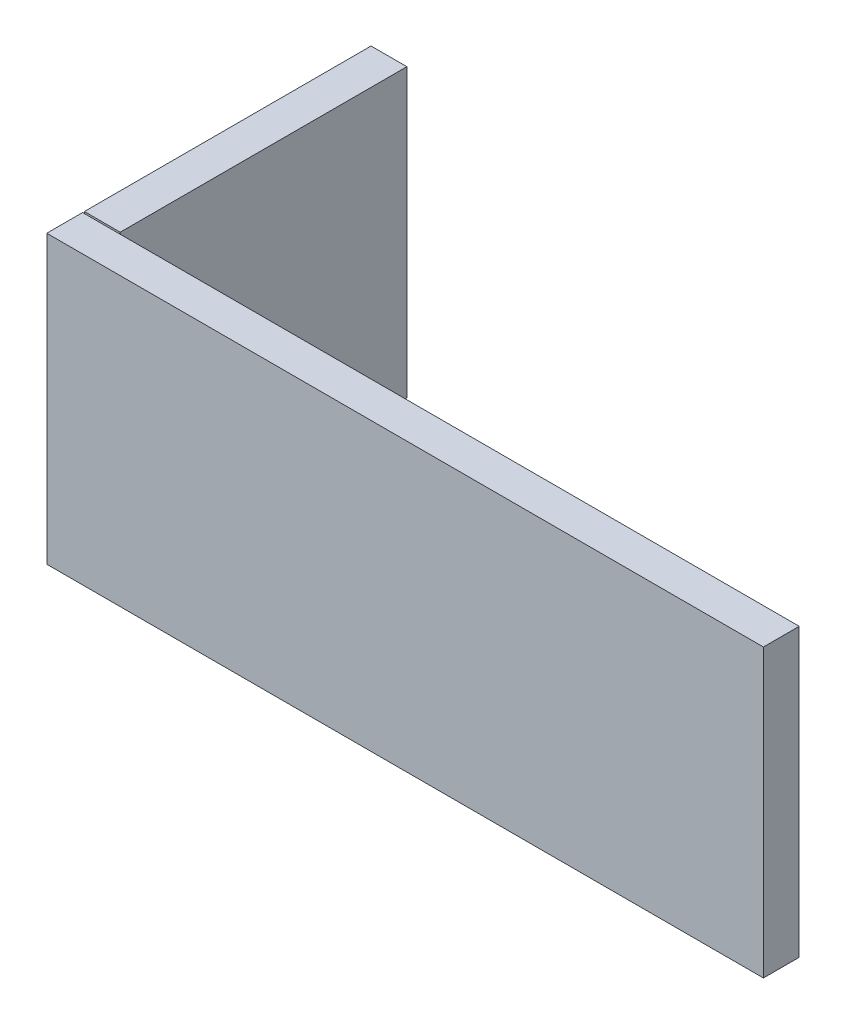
from build123d import *

# Parameters (mm, degrees)
SKETCH1_W             = 254
SKETCH1_H             = 12.7
BOSS_EXTRUDE1_DEPTH   = 101.6
SKETCH1_W_2           = 12.7
SKETCH1_H_2           = 101.6
BOSS_EXTRUDE1_2_DEPTH = 101.6


with BuildPart() as part:
    # Sketch1 → Boss-Extrude1 (new body)
    with BuildSketch(Plane(origin=(0, 0, 0), x_dir=(1, 0, 0), z_dir=(0, 1, 0))):
        with Locations((127, 6.35)):
            Rectangle(SKETCH1_W, SKETCH1_H)
    extrude(amount=BOSS_EXTRUDE1_DEPTH)


with BuildPart() as body_2:
    # Sketch1 → Boss-Extrude1 2 (new body)
    with BuildSketch(Plane(origin=(0, 0, 0), x_dir=(1, 0, 0), z_dir=(0, 1, 0))):
        with Locations((6.35, 64.135)):
            Rectangle(SKETCH1_W_2, SKETCH1_H_2)
    extrude(amount=BOSS_EXTRUDE1_2_DEPTH)


solid = Compound([part.part, body_2.part])
